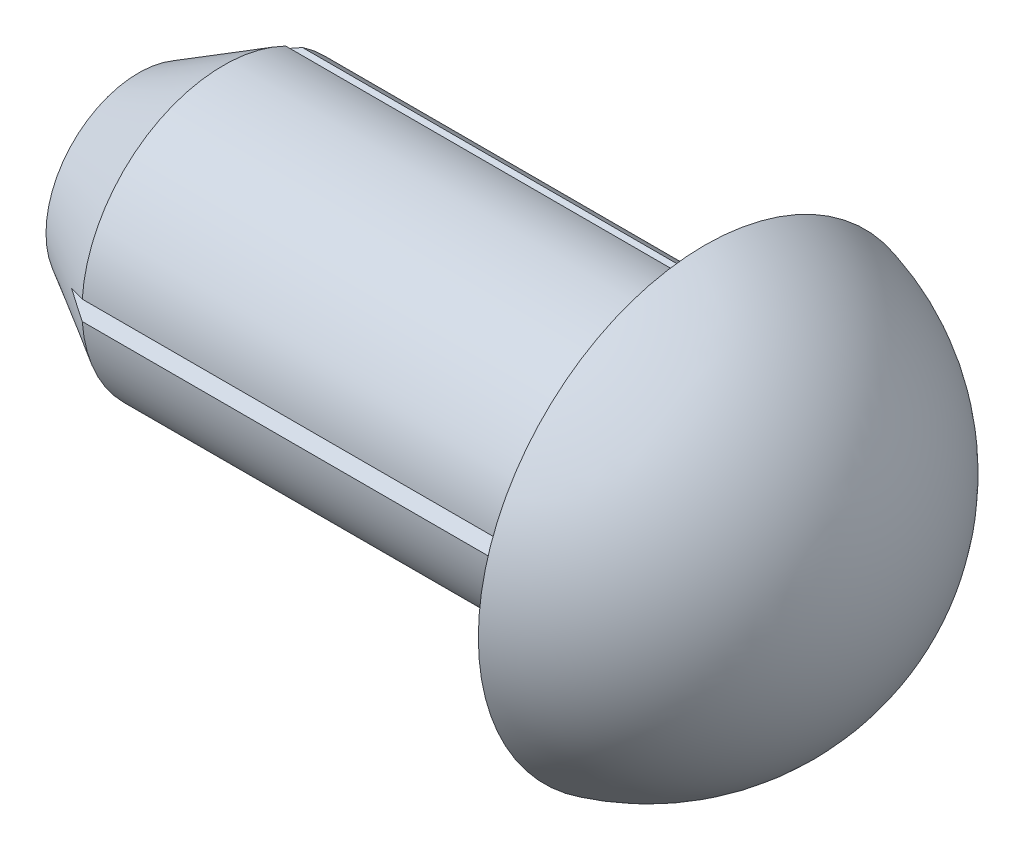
from build123d import *

# Parameters (mm, degrees)
CUT_EXTRUDE1_DEPTH = 37
CIRPATTERN1_COUNT  = 3


with BuildPart() as part:
    # Sketch1 → Base-Revolve (revolve)
    with BuildSketch(Plane.XY, mode=Mode.PRIVATE) as base_revolve_sk:
        with BuildLine():
            Line((-40, 0), (-40, 6.535898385))
            Line((-40, 6.535898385), (-34, 10))
            Line((-34, 10), (0, 10))
            Line((0, 10), (0, 16))
            ThreePointArc((0, 16), (8.983547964, 10.142395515), (12.468871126, 0))
            Line((12.468871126, 0), (-40, 0))
        make_face()
    revolve(base_revolve_sk.sketch.rotate(Axis((-40, 0, 0), (1, 0, 0)), 90), axis=Axis((-40, 0, 0), (1, 0, 0)))

    # Sketch2 → Cut-Extrude1 (cut)
    with BuildSketch(Plane.ZY.offset(40)):
        Polygon((9, 0), (10, 0.700207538), (10, -0.700207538), align=None)
    cut_extrude1 = extrude(amount=-CUT_EXTRUDE1_DEPTH, mode=Mode.SUBTRACT)

    # CirPattern1: Cut-Extrude1 ×3 about axis
    cirpattern1_axis = Axis((0, 0, 0), (1, 0, 0))
    for i in range(1, CIRPATTERN1_COUNT):
        add(cut_extrude1.rotate(cirpattern1_axis, i * 360 / CIRPATTERN1_COUNT), mode=Mode.SUBTRACT)


solid = part.part
